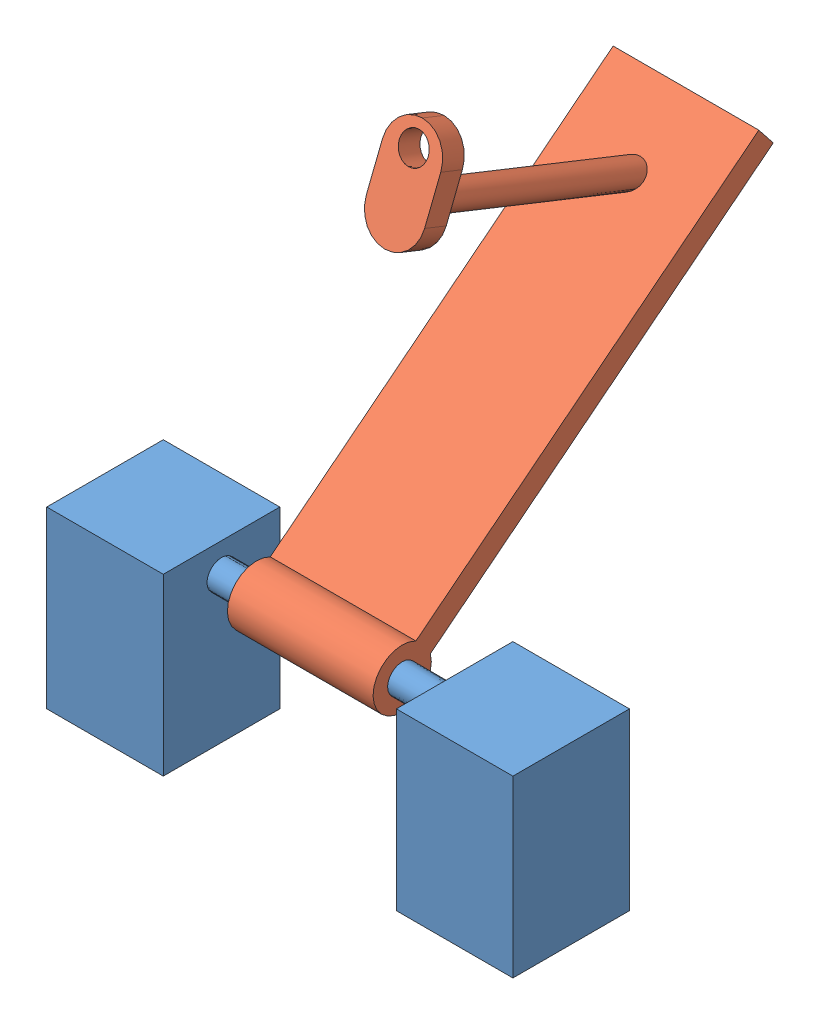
SolidWorks assembly 6.10. Assembl.SLDASM, configuration Default (file format 9000). Lengths in mm.
Overall size (160 218.21 193.87).
2 component instances, 2 part files, 2 mates.
Components (placement in the parent):
- 6.10. Assembly1-1: 6.10. Assembly1.SLDPRT [Default] at origin size (160 60 40)
- 6.10. Assembly2-1: 6.10. Assembly2.SLDPRT [Default] at (-3 68.6004 -23.5377) x (0 0.620014 -0.784591) z (1 0 0) size (169.17 98.61 50)
Mates (geometry in assembly coordinates):
- Concentric1: concentric anti-aligned: cylinder of 6.10. Assembly1-1 through (-500000 50 0) axis (1 0 0) radius 5; cylinder of 6.10. Assembly2-1 through (22 50 0) axis (-1 0 0) radius 5
- Width1: width = 12 mm anti-aligned: plane of 6.10. Assembly1-1 through (-40 60 20) normal (1 0 0); plane of 6.10. Assembly1-1 through (40 60 20) normal (-1 0 0); plane of 6.10. Assembly2-1 through (-28 68.6004 -23.5377) normal (-1 0 0); plane of 6.10. Assembly2-1 through (22 68.6004 -23.5377) normal (1 0 0)
